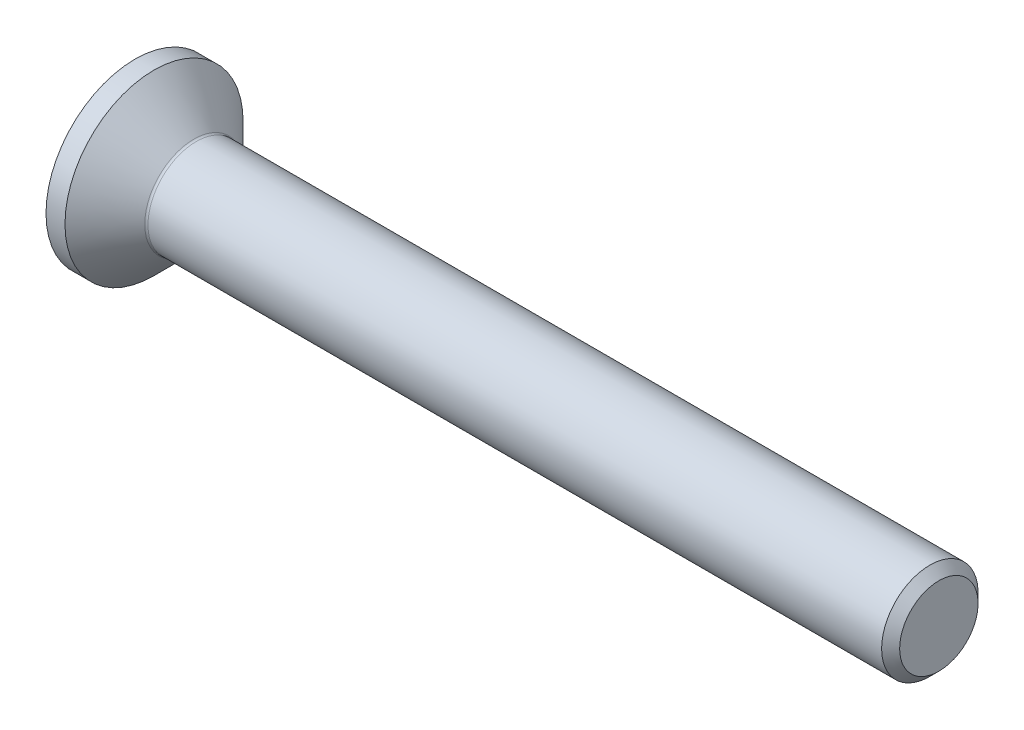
ISO-10303-21;
HEADER;
FILE_DESCRIPTION(('STEP AP214'),'2;1');
FILE_NAME('part.step','',(''),(''),'','','');
FILE_SCHEMA(('AUTOMOTIVE_DESIGN { 1 0 10303 214 1 1 1 1 }'));
ENDSEC;
DATA;
#1=APPLICATION_CONTEXT('core data for automotive mechanical design processes');
#2=APPLICATION_PROTOCOL_DEFINITION('international standard','automotive_design',2000,#1);
#3=PRODUCT_CONTEXT('',#1,'mechanical');
#4=PRODUCT('Part','Part','',(#3));
#5=PRODUCT_RELATED_PRODUCT_CATEGORY('part','',(#4));
#6=PRODUCT_DEFINITION_FORMATION('','',#4);
#7=PRODUCT_DEFINITION_CONTEXT('part definition',#1,'design');
#8=PRODUCT_DEFINITION('design','',#6,#7);
#9=PRODUCT_DEFINITION_SHAPE('','',#8);
#10=(LENGTH_UNIT() NAMED_UNIT(*) SI_UNIT(.MILLI.,.METRE.));
#11=(NAMED_UNIT(*) PLANE_ANGLE_UNIT() SI_UNIT($,.RADIAN.));
#12=(NAMED_UNIT(*) SI_UNIT($,.STERADIAN.) SOLID_ANGLE_UNIT());
#13=UNCERTAINTY_MEASURE_WITH_UNIT(LENGTH_MEASURE(1.E-05),#10,'distance_accuracy_value','');
#14=(GEOMETRIC_REPRESENTATION_CONTEXT(3) GLOBAL_UNCERTAINTY_ASSIGNED_CONTEXT((#13)) GLOBAL_UNIT_ASSIGNED_CONTEXT((#10,
#11,#12)) REPRESENTATION_CONTEXT('',''));
#15=CARTESIAN_POINT('',(0.,0.,0.));
#16=DIRECTION('',(0.,0.,1.));
#17=DIRECTION('',(1.,0.,0.));
#18=AXIS2_PLACEMENT_3D('',#15,#16,#17);
#19=CARTESIAN_POINT('',(0.,0.,0.));
#20=DIRECTION('',(-1.,0.,0.));
#21=DIRECTION('',(0.,0.,1.));
#22=AXIS2_PLACEMENT_3D('',#19,#20,#21);
#23=PLANE('',#22);
#24=CARTESIAN_POINT('',(0.,0.,0.));
#25=DIRECTION('',(-1.,0.,0.));
#26=DIRECTION('',(0.,0.,1.));
#27=AXIS2_PLACEMENT_3D('',#24,#25,#26);
#28=CIRCLE('',#27,2.77);
#29=CARTESIAN_POINT('',(0.,0.,2.77));
#30=VERTEX_POINT('',#29);
#31=EDGE_CURVE('E161',#30,#30,#28,.T.);
#32=ORIENTED_EDGE('',*,*,#31,.T.);
#33=EDGE_LOOP('',(#32));
#34=FACE_BOUND('',#33,.T.);
#35=DIRECTION('',(0.,-0.5,-0.866025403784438));
#36=VECTOR('',#35,1.);
#37=CARTESIAN_POINT('',(0.,-0.577350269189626,1.));
#38=LINE('',#37,#36);
#39=CARTESIAN_POINT('',(0.,-0.577350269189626,1.));
#40=VERTEX_POINT('',#39);
#41=CARTESIAN_POINT('',(0.,-1.15470053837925,0.));
#42=VERTEX_POINT('',#41);
#43=EDGE_CURVE('E123',#40,#42,#38,.T.);
#44=ORIENTED_EDGE('',*,*,#43,.T.);
#45=DIRECTION('',(0.,0.5,-0.866025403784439));
#46=VECTOR('',#45,1.);
#47=CARTESIAN_POINT('',(0.,-1.15470053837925,0.));
#48=LINE('',#47,#46);
#49=CARTESIAN_POINT('',(0.,-0.577350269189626,-1.));
#50=VERTEX_POINT('',#49);
#51=EDGE_CURVE('E53',#42,#50,#48,.T.);
#52=ORIENTED_EDGE('',*,*,#51,.T.);
#53=DIRECTION('',(0.,1.,0.));
#54=VECTOR('',#53,1.);
#55=CARTESIAN_POINT('',(0.,-0.577350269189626,-1.));
#56=LINE('',#55,#54);
#57=CARTESIAN_POINT('',(0.,0.577350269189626,-1.));
#58=VERTEX_POINT('',#57);
#59=EDGE_CURVE('E138',#50,#58,#56,.T.);
#60=ORIENTED_EDGE('',*,*,#59,.T.);
#61=DIRECTION('',(0.,0.5,0.866025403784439));
#62=VECTOR('',#61,1.);
#63=CARTESIAN_POINT('',(0.,0.577350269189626,-1.));
#64=LINE('',#63,#62);
#65=CARTESIAN_POINT('',(0.,1.15470053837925,0.));
#66=VERTEX_POINT('',#65);
#67=EDGE_CURVE('E274',#58,#66,#64,.T.);
#68=ORIENTED_EDGE('',*,*,#67,.T.);
#69=DIRECTION('',(0.,-0.5,0.866025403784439));
#70=VECTOR('',#69,1.);
#71=CARTESIAN_POINT('',(0.,1.15470053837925,0.));
#72=LINE('',#71,#70);
#73=CARTESIAN_POINT('',(0.,0.577350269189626,1.));
#74=VERTEX_POINT('',#73);
#75=EDGE_CURVE('E277',#66,#74,#72,.T.);
#76=ORIENTED_EDGE('',*,*,#75,.T.);
#77=DIRECTION('',(0.,-1.,0.));
#78=VECTOR('',#77,1.);
#79=CARTESIAN_POINT('',(0.,0.577350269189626,1.));
#80=LINE('',#79,#78);
#81=EDGE_CURVE('E280',#74,#40,#80,.T.);
#82=ORIENTED_EDGE('',*,*,#81,.T.);
#83=EDGE_LOOP('',(#44,#52,#60,#68,#76,#82));
#84=FACE_BOUND('',#83,.T.);
#85=ADVANCED_FACE('F38',(#34,#84),#23,.T.);
#86=CARTESIAN_POINT('',(0.,0.,0.));
#87=DIRECTION('',(-1.,0.,0.));
#88=DIRECTION('',(0.,0.,1.));
#89=AXIS2_PLACEMENT_3D('',#86,#87,#88);
#90=CYLINDRICAL_SURFACE('',#89,2.77);
#91=CARTESIAN_POINT('',(0.590000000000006,0.,0.));
#92=DIRECTION('',(-1.,0.,0.));
#93=DIRECTION('',(0.,0.,1.));
#94=AXIS2_PLACEMENT_3D('',#91,#92,#93);
#95=CIRCLE('',#94,2.77);
#96=CARTESIAN_POINT('',(0.590000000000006,0.,2.77));
#97=VERTEX_POINT('',#96);
#98=EDGE_CURVE('E158',#97,#97,#95,.T.);
#99=ORIENTED_EDGE('',*,*,#98,.T.);
#100=EDGE_LOOP('',(#99));
#101=FACE_BOUND('',#100,.T.);
#102=ORIENTED_EDGE('',*,*,#31,.F.);
#103=EDGE_LOOP('',(#102));
#104=FACE_BOUND('',#103,.T.);
#105=ADVANCED_FACE('F182',(#101,#104),#90,.T.);
#106=CARTESIAN_POINT('',(0.590000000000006,0.,0.));
#107=DIRECTION('',(-1.,0.,0.));
#108=DIRECTION('',(0.,0.,1.));
#109=AXIS2_PLACEMENT_3D('',#106,#107,#108);
#110=CONICAL_SURFACE('',#109,2.77,0.78539816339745);
#111=CARTESIAN_POINT('',(1.83071067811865,0.,0.));
#112=DIRECTION('',(-1.,0.,0.));
#113=DIRECTION('',(0.,0.,1.));
#114=AXIS2_PLACEMENT_3D('',#111,#112,#113);
#115=CIRCLE('',#114,1.52928932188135);
#116=CARTESIAN_POINT('',(1.83071067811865,0.,1.52928932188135));
#117=VERTEX_POINT('',#116);
#118=EDGE_CURVE('E46',#117,#117,#115,.T.);
#119=ORIENTED_EDGE('',*,*,#118,.T.);
#120=EDGE_LOOP('',(#119));
#121=FACE_BOUND('',#120,.T.);
#122=ORIENTED_EDGE('',*,*,#98,.F.);
#123=EDGE_LOOP('',(#122));
#124=FACE_BOUND('',#123,.T.);
#125=ADVANCED_FACE('F166',(#121,#124),#110,.T.);
#126=CARTESIAN_POINT('',(0.,0.,0.));
#127=DIRECTION('',(-1.,0.,0.));
#128=DIRECTION('',(0.,0.,1.));
#129=AXIS2_PLACEMENT_3D('',#126,#127,#128);
#130=CYLINDRICAL_SURFACE('',#129,1.5);
#131=CARTESIAN_POINT('',(1.90142135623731,0.,0.));
#132=DIRECTION('',(-1.,0.,0.));
#133=DIRECTION('',(0.,0.,1.));
#134=AXIS2_PLACEMENT_3D('',#131,#132,#133);
#135=CIRCLE('',#134,1.5);
#136=CARTESIAN_POINT('',(1.90142135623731,0.,1.5));
#137=VERTEX_POINT('',#136);
#138=EDGE_CURVE('E11',#137,#137,#135,.F.);
#139=ORIENTED_EDGE('',*,*,#138,.T.);
#140=EDGE_LOOP('',(#139));
#141=FACE_BOUND('',#140,.T.);
#142=CARTESIAN_POINT('',(24.7195,0.,0.));
#143=DIRECTION('',(-1.,0.,0.));
#144=DIRECTION('',(0.,0.,1.));
#145=AXIS2_PLACEMENT_3D('',#142,#143,#144);
#146=CIRCLE('',#145,1.5);
#147=CARTESIAN_POINT('',(24.7195,0.,1.5));
#148=VERTEX_POINT('',#147);
#149=EDGE_CURVE('E155',#148,#148,#146,.T.);
#150=ORIENTED_EDGE('',*,*,#149,.T.);
#151=EDGE_LOOP('',(#150));
#152=FACE_BOUND('',#151,.T.);
#153=ADVANCED_FACE('F193',(#141,#152),#130,.T.);
#154=CARTESIAN_POINT('',(25.,0.,0.));
#155=DIRECTION('',(-1.,0.,0.));
#156=DIRECTION('',(0.,0.,1.));
#157=AXIS2_PLACEMENT_3D('',#154,#155,#156);
#158=CONICAL_SURFACE('',#157,1.2195,0.785398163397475);
#159=ORIENTED_EDGE('',*,*,#149,.F.);
#160=EDGE_LOOP('',(#159));
#161=FACE_BOUND('',#160,.T.);
#162=CARTESIAN_POINT('',(25.,0.,0.));
#163=DIRECTION('',(-1.,0.,0.));
#164=DIRECTION('',(0.,0.,1.));
#165=AXIS2_PLACEMENT_3D('',#162,#163,#164);
#166=CIRCLE('',#165,1.2195);
#167=CARTESIAN_POINT('',(25.,0.,1.2195));
#168=VERTEX_POINT('',#167);
#169=EDGE_CURVE('E151',#168,#168,#166,.T.);
#170=ORIENTED_EDGE('',*,*,#169,.T.);
#171=EDGE_LOOP('',(#170));
#172=FACE_BOUND('',#171,.T.);
#173=ADVANCED_FACE('F177',(#161,#172),#158,.T.);
#174=CARTESIAN_POINT('',(25.,1.2195,0.));
#175=DIRECTION('',(1.,0.,0.));
#176=DIRECTION('',(0.,0.,-1.));
#177=AXIS2_PLACEMENT_3D('',#174,#175,#176);
#178=PLANE('',#177);
#179=ORIENTED_EDGE('',*,*,#169,.F.);
#180=EDGE_LOOP('',(#179));
#181=FACE_BOUND('',#180,.T.);
#182=ADVANCED_FACE('F170',(#181),#178,.T.);
#183=CARTESIAN_POINT('',(1.90142135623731,0.,0.));
#184=DIRECTION('',(-1.,0.,0.));
#185=DIRECTION('',(0.,0.,1.));
#186=AXIS2_PLACEMENT_3D('',#183,#184,#185);
#187=TOROIDAL_SURFACE('',#186,1.6,0.1);
#188=ORIENTED_EDGE('',*,*,#138,.F.);
#189=EDGE_LOOP('',(#188));
#190=FACE_BOUND('',#189,.T.);
#191=ORIENTED_EDGE('',*,*,#118,.F.);
#192=EDGE_LOOP('',(#191));
#193=FACE_BOUND('',#192,.T.);
#194=ADVANCED_FACE('F40',(#190,#193),#187,.F.);
#195=CARTESIAN_POINT('',(1.1,-1.15470053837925,0.));
#196=DIRECTION('',(0.,0.866025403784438,0.5));
#197=DIRECTION('',(0.,-0.5,0.866025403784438));
#198=AXIS2_PLACEMENT_3D('',#195,#196,#197);
#199=PLANE('',#198);
#200=ORIENTED_EDGE('',*,*,#51,.F.);
#201=DIRECTION('',(-1.,0.,0.));
#202=VECTOR('',#201,1.);
#203=CARTESIAN_POINT('',(1.1,-1.15470053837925,0.));
#204=LINE('',#203,#202);
#205=CARTESIAN_POINT('',(1.1,-1.15470053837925,0.));
#206=VERTEX_POINT('',#205);
#207=EDGE_CURVE('E271',#206,#42,#204,.T.);
#208=ORIENTED_EDGE('',*,*,#207,.F.);
#209=DIRECTION('',(0.,0.5,-0.866025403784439));
#210=VECTOR('',#209,1.);
#211=CARTESIAN_POINT('',(1.1,-1.15470053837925,0.));
#212=LINE('',#211,#210);
#213=CARTESIAN_POINT('',(1.1,-0.866025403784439,-0.500000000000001));
#214=VERTEX_POINT('',#213);
#215=EDGE_CURVE('E120',#206,#214,#212,.T.);
#216=ORIENTED_EDGE('',*,*,#215,.T.);
#217=CARTESIAN_POINT('',(1.1,-0.577350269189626,-1.));
#218=VERTEX_POINT('',#217);
#219=EDGE_CURVE('E114',#214,#218,#212,.T.);
#220=ORIENTED_EDGE('',*,*,#219,.T.);
#221=DIRECTION('',(-1.,0.,0.));
#222=VECTOR('',#221,1.);
#223=CARTESIAN_POINT('',(1.1,-0.577350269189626,-1.));
#224=LINE('',#223,#222);
#225=EDGE_CURVE('E118',#218,#50,#224,.T.);
#226=ORIENTED_EDGE('',*,*,#225,.T.);
#227=EDGE_LOOP('',(#200,#208,#216,#220,#226));
#228=FACE_BOUND('',#227,.T.);
#229=ADVANCED_FACE('F116',(#228),#199,.T.);
#230=CARTESIAN_POINT('',(1.1,-0.577350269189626,-1.));
#231=DIRECTION('',(0.,0.,1.));
#232=DIRECTION('',(1.,0.,0.));
#233=AXIS2_PLACEMENT_3D('',#230,#231,#232);
#234=PLANE('',#233);
#235=ORIENTED_EDGE('',*,*,#59,.F.);
#236=ORIENTED_EDGE('',*,*,#225,.F.);
#237=DIRECTION('',(0.,1.,0.));
#238=VECTOR('',#237,1.);
#239=CARTESIAN_POINT('',(1.1,-0.577350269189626,-1.));
#240=LINE('',#239,#238);
#241=CARTESIAN_POINT('',(1.1,0.,-1.));
#242=VERTEX_POINT('',#241);
#243=EDGE_CURVE('E126',#218,#242,#240,.T.);
#244=ORIENTED_EDGE('',*,*,#243,.T.);
#245=CARTESIAN_POINT('',(1.1,0.577350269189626,-1.));
#246=VERTEX_POINT('',#245);
#247=EDGE_CURVE('E133',#242,#246,#240,.T.);
#248=ORIENTED_EDGE('',*,*,#247,.T.);
#249=DIRECTION('',(-1.,0.,0.));
#250=VECTOR('',#249,1.);
#251=CARTESIAN_POINT('',(1.1,0.577350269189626,-1.));
#252=LINE('',#251,#250);
#253=EDGE_CURVE('E140',#246,#58,#252,.T.);
#254=ORIENTED_EDGE('',*,*,#253,.T.);
#255=EDGE_LOOP('',(#235,#236,#244,#248,#254));
#256=FACE_BOUND('',#255,.T.);
#257=ADVANCED_FACE('F135',(#256),#234,.T.);
#258=CARTESIAN_POINT('',(1.1,0.577350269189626,-1.));
#259=DIRECTION('',(0.,-0.866025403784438,0.5));
#260=DIRECTION('',(0.,-0.5,-0.866025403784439));
#261=AXIS2_PLACEMENT_3D('',#258,#259,#260);
#262=PLANE('',#261);
#263=ORIENTED_EDGE('',*,*,#67,.F.);
#264=ORIENTED_EDGE('',*,*,#253,.F.);
#265=DIRECTION('',(0.,0.5,0.866025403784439));
#266=VECTOR('',#265,1.);
#267=CARTESIAN_POINT('',(1.1,0.577350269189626,-1.));
#268=LINE('',#267,#266);
#269=CARTESIAN_POINT('',(1.1,0.866025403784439,-0.5));
#270=VERTEX_POINT('',#269);
#271=EDGE_CURVE('E263',#246,#270,#268,.T.);
#272=ORIENTED_EDGE('',*,*,#271,.T.);
#273=CARTESIAN_POINT('',(1.1,1.15470053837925,0.));
#274=VERTEX_POINT('',#273);
#275=EDGE_CURVE('E132',#270,#274,#268,.T.);
#276=ORIENTED_EDGE('',*,*,#275,.T.);
#277=DIRECTION('',(-1.,0.,0.));
#278=VECTOR('',#277,1.);
#279=CARTESIAN_POINT('',(1.1,1.15470053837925,0.));
#280=LINE('',#279,#278);
#281=EDGE_CURVE('E146',#274,#66,#280,.T.);
#282=ORIENTED_EDGE('',*,*,#281,.T.);
#283=EDGE_LOOP('',(#263,#264,#272,#276,#282));
#284=FACE_BOUND('',#283,.T.);
#285=ADVANCED_FACE('F207',(#284),#262,.T.);
#286=CARTESIAN_POINT('',(1.1,1.15470053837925,0.));
#287=DIRECTION('',(0.,-0.866025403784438,-0.5));
#288=DIRECTION('',(0.,0.5,-0.866025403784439));
#289=AXIS2_PLACEMENT_3D('',#286,#287,#288);
#290=PLANE('',#289);
#291=ORIENTED_EDGE('',*,*,#75,.F.);
#292=ORIENTED_EDGE('',*,*,#281,.F.);
#293=DIRECTION('',(0.,-0.5,0.866025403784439));
#294=VECTOR('',#293,1.);
#295=CARTESIAN_POINT('',(1.1,1.15470053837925,0.));
#296=LINE('',#295,#294);
#297=CARTESIAN_POINT('',(1.1,0.866025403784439,0.5));
#298=VERTEX_POINT('',#297);
#299=EDGE_CURVE('E61',#274,#298,#296,.T.);
#300=ORIENTED_EDGE('',*,*,#299,.T.);
#301=CARTESIAN_POINT('',(1.1,0.577350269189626,1.));
#302=VERTEX_POINT('',#301);
#303=EDGE_CURVE('E242',#298,#302,#296,.T.);
#304=ORIENTED_EDGE('',*,*,#303,.T.);
#305=DIRECTION('',(-1.,0.,0.));
#306=VECTOR('',#305,1.);
#307=CARTESIAN_POINT('',(1.1,0.577350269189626,1.));
#308=LINE('',#307,#306);
#309=EDGE_CURVE('E256',#302,#74,#308,.T.);
#310=ORIENTED_EDGE('',*,*,#309,.T.);
#311=EDGE_LOOP('',(#291,#292,#300,#304,#310));
#312=FACE_BOUND('',#311,.T.);
#313=ADVANCED_FACE('F210',(#312),#290,.T.);
#314=CARTESIAN_POINT('',(1.1,0.577350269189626,1.));
#315=DIRECTION('',(0.,0.,-1.));
#316=DIRECTION('',(-1.,0.,0.));
#317=AXIS2_PLACEMENT_3D('',#314,#315,#316);
#318=PLANE('',#317);
#319=ORIENTED_EDGE('',*,*,#81,.F.);
#320=ORIENTED_EDGE('',*,*,#309,.F.);
#321=DIRECTION('',(0.,-1.,0.));
#322=VECTOR('',#321,1.);
#323=CARTESIAN_POINT('',(1.1,0.577350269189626,1.));
#324=LINE('',#323,#322);
#325=CARTESIAN_POINT('',(1.1,0.,1.));
#326=VERTEX_POINT('',#325);
#327=EDGE_CURVE('E241',#302,#326,#324,.T.);
#328=ORIENTED_EDGE('',*,*,#327,.T.);
#329=CARTESIAN_POINT('',(1.1,-0.577350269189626,1.));
#330=VERTEX_POINT('',#329);
#331=EDGE_CURVE('E247',#326,#330,#324,.T.);
#332=ORIENTED_EDGE('',*,*,#331,.T.);
#333=DIRECTION('',(-1.,0.,0.));
#334=VECTOR('',#333,1.);
#335=CARTESIAN_POINT('',(1.1,-0.577350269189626,1.));
#336=LINE('',#335,#334);
#337=EDGE_CURVE('E286',#330,#40,#336,.T.);
#338=ORIENTED_EDGE('',*,*,#337,.T.);
#339=EDGE_LOOP('',(#319,#320,#328,#332,#338));
#340=FACE_BOUND('',#339,.T.);
#341=ADVANCED_FACE('F214',(#340),#318,.T.);
#342=CARTESIAN_POINT('',(1.1,-0.577350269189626,1.));
#343=DIRECTION('',(0.,0.866025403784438,-0.5));
#344=DIRECTION('',(0.,0.5,0.866025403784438));
#345=AXIS2_PLACEMENT_3D('',#342,#343,#344);
#346=PLANE('',#345);
#347=ORIENTED_EDGE('',*,*,#43,.F.);
#348=ORIENTED_EDGE('',*,*,#337,.F.);
#349=DIRECTION('',(0.,-0.5,-0.866025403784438));
#350=VECTOR('',#349,1.);
#351=CARTESIAN_POINT('',(1.1,-0.577350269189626,1.));
#352=LINE('',#351,#350);
#353=CARTESIAN_POINT('',(1.1,-0.866025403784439,0.500000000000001));
#354=VERTEX_POINT('',#353);
#355=EDGE_CURVE('E250',#330,#354,#352,.T.);
#356=ORIENTED_EDGE('',*,*,#355,.T.);
#357=EDGE_CURVE('E257',#354,#206,#352,.T.);
#358=ORIENTED_EDGE('',*,*,#357,.T.);
#359=ORIENTED_EDGE('',*,*,#207,.T.);
#360=EDGE_LOOP('',(#347,#348,#356,#358,#359));
#361=FACE_BOUND('',#360,.T.);
#362=ADVANCED_FACE('F217',(#361),#346,.T.);
#363=CARTESIAN_POINT('',(1.1,-1.15470053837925,0.));
#364=DIRECTION('',(-1.,0.,0.));
#365=DIRECTION('',(0.,0.,1.));
#366=AXIS2_PLACEMENT_3D('',#363,#364,#365);
#367=PLANE('',#366);
#368=CARTESIAN_POINT('',(1.1,0.,0.));
#369=DIRECTION('',(-1.,0.,0.));
#370=DIRECTION('',(0.,0.,1.));
#371=AXIS2_PLACEMENT_3D('',#368,#369,#370);
#372=CIRCLE('',#371,1.);
#373=EDGE_CURVE('E139',#354,#326,#372,.T.);
#374=ORIENTED_EDGE('',*,*,#373,.F.);
#375=ORIENTED_EDGE('',*,*,#355,.F.);
#376=ORIENTED_EDGE('',*,*,#331,.F.);
#377=EDGE_LOOP('',(#374,#375,#376));
#378=FACE_BOUND('',#377,.T.);
#379=ADVANCED_FACE('F221',(#378),#367,.T.);
#380=EDGE_CURVE('E143',#214,#354,#372,.T.);
#381=ORIENTED_EDGE('',*,*,#380,.F.);
#382=ORIENTED_EDGE('',*,*,#215,.F.);
#383=ORIENTED_EDGE('',*,*,#357,.F.);
#384=EDGE_LOOP('',(#381,#382,#383));
#385=FACE_BOUND('',#384,.T.);
#386=ADVANCED_FACE('F224',(#385),#367,.T.);
#387=EDGE_CURVE('E128',#242,#214,#372,.T.);
#388=ORIENTED_EDGE('',*,*,#387,.F.);
#389=ORIENTED_EDGE('',*,*,#243,.F.);
#390=ORIENTED_EDGE('',*,*,#219,.F.);
#391=EDGE_LOOP('',(#388,#389,#390));
#392=FACE_BOUND('',#391,.T.);
#393=ADVANCED_FACE('F127',(#392),#367,.T.);
#394=EDGE_CURVE('E259',#270,#242,#372,.T.);
#395=ORIENTED_EDGE('',*,*,#394,.F.);
#396=ORIENTED_EDGE('',*,*,#271,.F.);
#397=ORIENTED_EDGE('',*,*,#247,.F.);
#398=EDGE_LOOP('',(#395,#396,#397));
#399=FACE_BOUND('',#398,.T.);
#400=ADVANCED_FACE('F236',(#399),#367,.T.);
#401=EDGE_CURVE('E152',#298,#270,#372,.T.);
#402=ORIENTED_EDGE('',*,*,#401,.F.);
#403=ORIENTED_EDGE('',*,*,#299,.F.);
#404=ORIENTED_EDGE('',*,*,#275,.F.);
#405=EDGE_LOOP('',(#402,#403,#404));
#406=FACE_BOUND('',#405,.T.);
#407=ADVANCED_FACE('F231',(#406),#367,.T.);
#408=EDGE_CURVE('E145',#326,#298,#372,.T.);
#409=ORIENTED_EDGE('',*,*,#408,.F.);
#410=ORIENTED_EDGE('',*,*,#327,.F.);
#411=ORIENTED_EDGE('',*,*,#303,.F.);
#412=EDGE_LOOP('',(#409,#410,#411));
#413=FACE_BOUND('',#412,.T.);
#414=ADVANCED_FACE('F202',(#413),#367,.T.);
#415=CARTESIAN_POINT('',(1.1,0.,0.));
#416=DIRECTION('',(-1.,0.,0.));
#417=DIRECTION('',(0.,0.,1.));
#418=AXIS2_PLACEMENT_3D('',#415,#416,#417);
#419=CONICAL_SURFACE('',#418,1.,1.04719755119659);
#420=CARTESIAN_POINT('',(1.67735026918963,0.,0.));
#421=VERTEX_POINT('',#420);
#422=VERTEX_LOOP('',#421);
#423=FACE_BOUND('',#422,.T.);
#424=ORIENTED_EDGE('',*,*,#408,.T.);
#425=ORIENTED_EDGE('',*,*,#401,.T.);
#426=ORIENTED_EDGE('',*,*,#394,.T.);
#427=ORIENTED_EDGE('',*,*,#387,.T.);
#428=ORIENTED_EDGE('',*,*,#380,.T.);
#429=ORIENTED_EDGE('',*,*,#373,.T.);
#430=EDGE_LOOP('',(#424,#425,#426,#427,#428,#429));
#431=FACE_BOUND('',#430,.T.);
#432=ADVANCED_FACE('F200',(#423,#431),#419,.F.);
#433=CLOSED_SHELL('',(#85,#105,#125,#153,#173,#182,#194,#229,#257,#285,#313,#341,#362,#379,#386,
#393,#400,#407,#414,#432));
#434=MANIFOLD_SOLID_BREP('B2',#433);
#435=ADVANCED_BREP_SHAPE_REPRESENTATION('',(#18,#434),#14);
#436=SHAPE_DEFINITION_REPRESENTATION(#9,#435);
ENDSEC;
END-ISO-10303-21;
